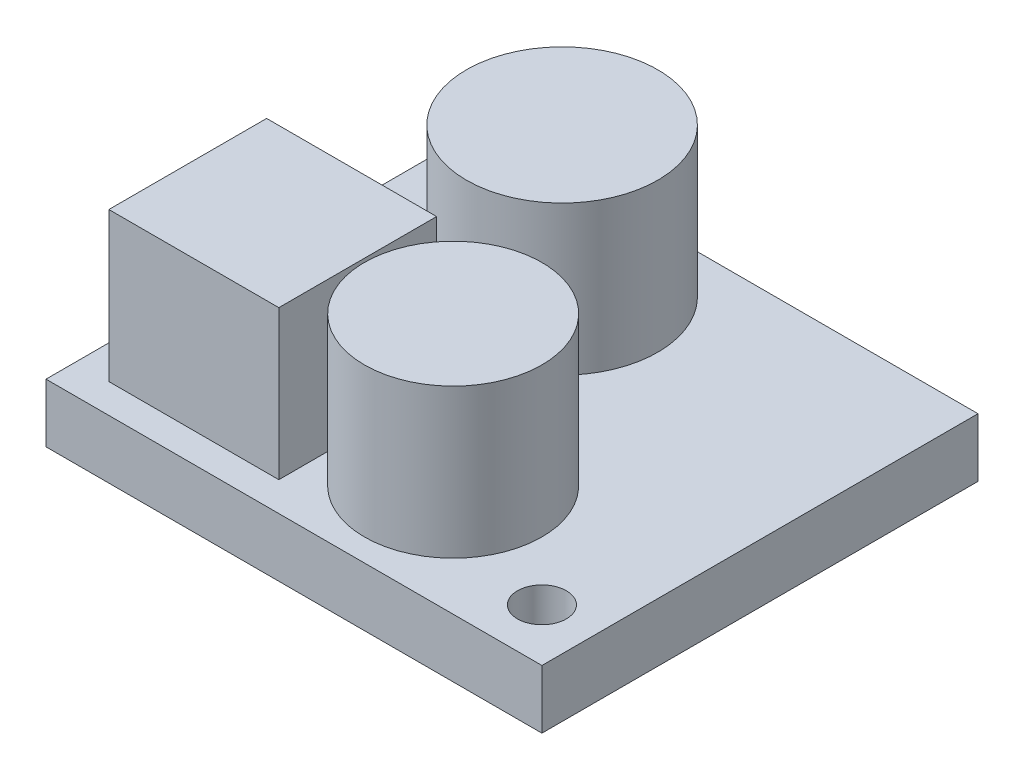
from build123d import *

# Parameters (mm, degrees)
SKETCH2_W           = 20.3
SKETCH2_H           = 17.85
SKETCH2_R           = 1
SKETCH2_R_2         = 3.63330205
SKETCH2_R_3         = 3.917055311
SKETCH2_W_2         = 6.957396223
SKETCH2_H_2         = 6.457890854
BOSS_EXTRUDE1_DEPTH = 2.4
SKETCH2_2_W         = 6.957396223
SKETCH2_2_H         = 6.457890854
SKETCH2_2_R         = 3.63330205
SKETCH2_2_R_2       = 3.917055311
BOSS_EXTRUDE2_DEPTH = 8.5


with BuildPart() as part:
    # Sketch2 → Boss-Extrude1 (new body)
    with BuildSketch(Plane(origin=(0, 0, 0), x_dir=(1, 0, 0), z_dir=(0, 1, 0))):
        with Locations((10.15, 8.925)):
            Rectangle(SKETCH2_W, SKETCH2_H)
        with Locations(Location((2.15, 15.7, 0), (0, 0, 270))):
            Circle(SKETCH2_R, mode=Mode.SUBTRACT)
        with Locations(Location((18.15, 2.15, 0), (0, 0, 270))):
            Circle(SKETCH2_R, mode=Mode.SUBTRACT)
        with Locations(Location((12.112342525, 4.554328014, 0), (0, 0, 270))):
            Circle(SKETCH2_R_2, mode=Mode.SUBTRACT)
        with Locations(Location((7.652473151, 13.474066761, 0), (0, 0, 270))):
            Circle(SKETCH2_R_3, mode=Mode.SUBTRACT)
        with Locations((4.851675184, 4.429451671)):
            Rectangle(SKETCH2_W_2, SKETCH2_H_2, mode=Mode.SUBTRACT)
    extrude(amount=BOSS_EXTRUDE1_DEPTH)

    # Sketch2_2 → Boss-Extrude2 (add)
    with BuildSketch(Plane(origin=(0, 0, 0), x_dir=(1, 0, 0), z_dir=(0, 1, 0))):
        with Locations((4.851675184, 4.429451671)):
            Rectangle(SKETCH2_2_W, SKETCH2_2_H)
        with Locations(Location((12.112342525, 4.554328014, 0), (0, 0, 270))):
            Circle(SKETCH2_2_R)
        with Locations(Location((7.652473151, 13.474066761, 0), (0, 0, 270))):
            Circle(SKETCH2_2_R_2)
    extrude(amount=BOSS_EXTRUDE2_DEPTH)


solid = part.part
